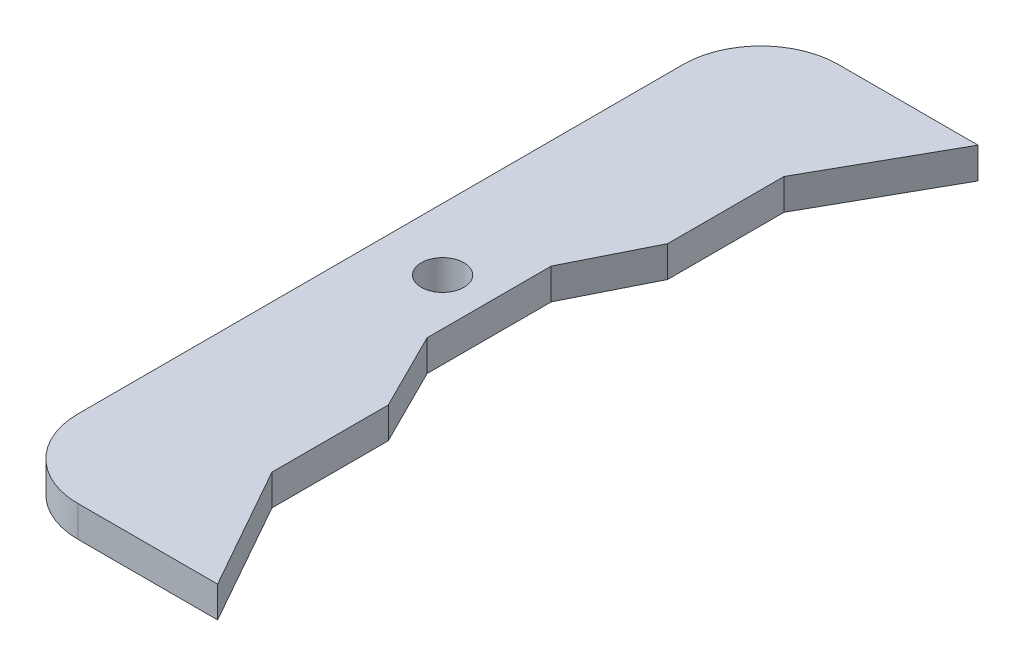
from build123d import *

# Parameters (mm, degrees)
SKETCH1_R      = 2.75
EXTRUDE1_DEPTH = 4


with BuildPart() as part:
    # Sketch1 → Extrude1 (new body)
    with BuildSketch(Plane(origin=(0, 0, 0), x_dir=(1, 0, 0), z_dir=(0, 1, 0))):
        with BuildLine():
            Line((10, 0), (28, 0))
            Line((28, 0), (19, 16))
            Line((19, 16), (19, 31))
            Line((19, 31), (14, 41))
            Line((14, 41), (14, 57))
            Line((14, 57), (19, 67))
            Line((19, 67), (19, 82))
            Line((19, 82), (28, 98))
            Line((28, 98), (10, 98))
            ThreePointArc((10, 98), (2.928932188, 95.071067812), (0, 88))
            Line((0, 88), (0, 10))
            ThreePointArc((0, 10), (2.928932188, 2.928932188), (10, 0))
        make_face()
        with Locations(Location((8, 49, 0), (0, 0, 270))):
            Circle(SKETCH1_R, mode=Mode.SUBTRACT)
    extrude(amount=EXTRUDE1_DEPTH)


solid = part.part
